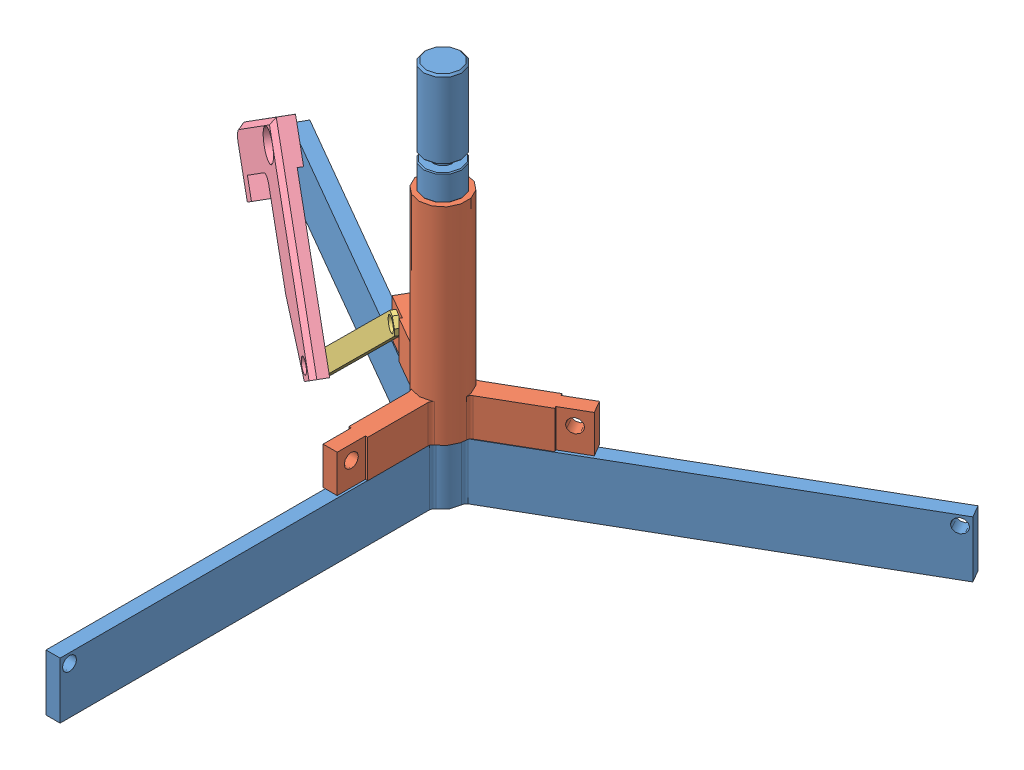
SolidWorks assembly claw-mechanism.sldasm, configuration Default (file format 4100). Lengths in mm.
Overall size (517.37 355.74 419.93).
7 component instances, 5 part files, 11 mates.
Components (placement in the parent):
- center-1: center.SLDPRT [Default] at origin size (461.2 254 399.41)
- collar-1: collar.sldprt [Default] at (0 39.5529 0) size (136.74 139.7 118.42)
- con-rod-1: con-rod.SLDPRT [Default] at (-59.5556 64.3842 -28.8852) x (-0.65545 -0.65359 -0.378424) z (-0.5 0 0.866025) size (177.8 12.7 3.17)
- claw-1: claw.sldprt [Default] at (-231.4513 31.75 -113.4645) x (-0.511283 0.807126 -0.295189) z (0.5 0 -0.866025) size (127 82.55 12.7)
- pin-1: pin.sldprt [Default] at (-61.711 55.4279 -26.4634) x (0.86382 -0.071327 0.498727) z (-0.061771 -0.997453 -0.035663) (suppressed, hidden)
- pin-2: pin.sldprt [Default] at (-229.2288 31.75 -117.314) x (-0.287599 -0.943247 -0.166045) z (-0.816876 0.332091 -0.471624) (suppressed, hidden)
- pin-3: pin.sldprt [Default] at (-174.6884 -52.4798 -80.6924) x (-0.530785 -0.790162 -0.306449) z (-0.684301 0.612897 -0.395081) (suppressed, hidden)
Mates (geometry in assembly coordinates):
- Concentric1: concentric aligned: cylinder of center-1 through (0 112.3855 0) axis (0 1 0) radius 12.7; cylinder of collar-1 through (0 157.7766 0) axis (0 1 0) radius 15.875
- Concentric2: concentric anti-aligned: cylinder of collar-1 through (-22.3654 55.4279 -94.6119) axis (-0.5 0 0.866025) radius 4.7625; cylinder of con-rod-1 through (-61.711 55.4279 -26.4634) axis (0.5 0 -0.866025) radius 4.7625
- Concentric3: concentric anti-aligned: cylinder of collar-1; cylinder of pin-1
- Coincident1: coincident anti-aligned: plane of con-rod-1 through (-53.9546 54.7722 -21.9853) normal (-0.5 0 0.866025); plane of pin-1
- Concentric4: concentric aligned: cylinder of con-rod-1 through (-169.9259 -52.4798 -88.9413) axis (0.5 0 -0.866025) radius 4.7625; cylinder of claw-1 through (-174.6884 -52.4798 -80.6924) axis (0.5 0 -0.866025) radius 4.7625
- Concentric5: concentric anti-aligned: cylinder of center-1 through (-106.2292 31.75 -330.3557) axis (-0.5 0 0.866025) radius 4.7625; cylinder of claw-1 through (-231.4513 31.75 -113.4645) axis (0.5 0 -0.866025) radius 4.7625
- Coincident2: coincident anti-aligned: plane of center-1 through (-230.6006 0 -127.6381) normal (-0.5 0 0.866025); plane of claw-1 through (-175.5389 -68.0023 -95.8482) normal (0.5 0 -0.866025)
- Concentric6: concentric aligned: cylinder of claw-1; cylinder of pin-2
- Coincident3: coincident anti-aligned: plane of claw-1 through (-229.2288 31.75 -117.314) normal (-0.5 0 0.866025); plane of pin-2
- Concentric7: concentric aligned: cylinder of claw-1; cylinder of pin-3
- Coincident4: coincident anti-aligned: plane of claw-1 through (-181.8889 -68.0023 -84.8496) normal (-0.5 0 0.866025); cylinder of collar-1 through (0 157.7766 0) axis (0 1 0) radius 15.875; plane of center-1 through (-230.6006 0 -127.6381) normal (-0.5 0 0.866025); plane of center-1 through (-230.6006 0 -127.6381) normal (-0.5 0 0.866025); plane of center-1 through (-230.6006 0 -127.6381) normal (-0.5 0 0.866025)
